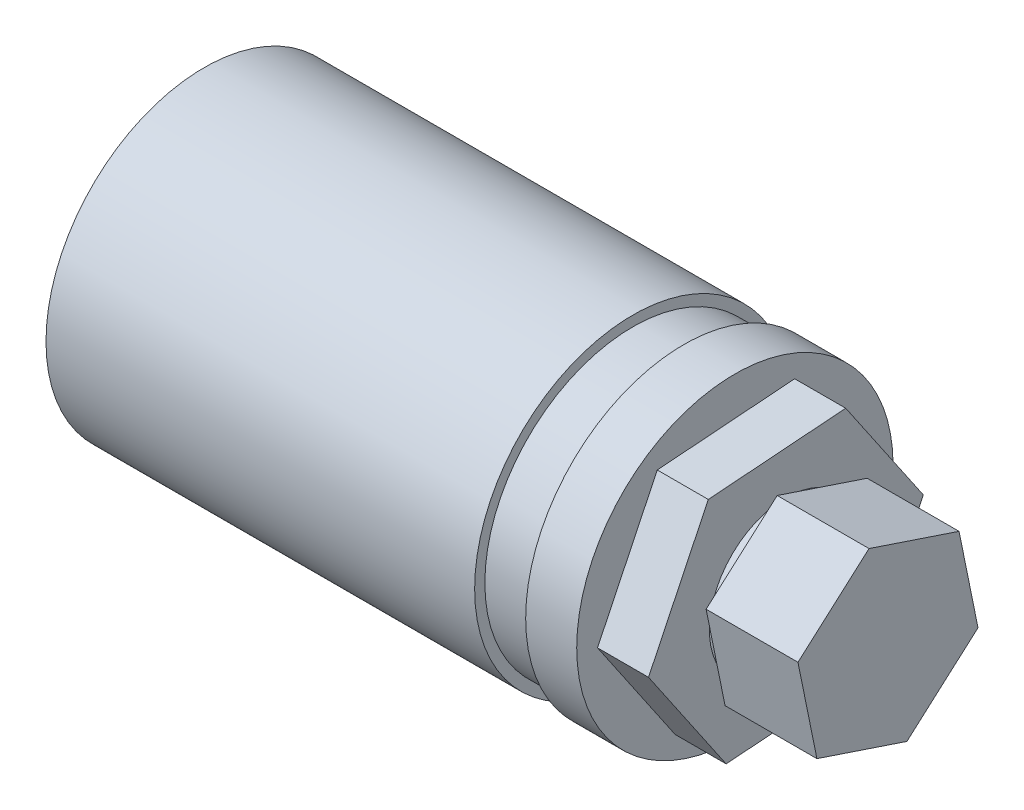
ISO-10303-21;
HEADER;
FILE_DESCRIPTION(('STEP AP214'),'2;1');
FILE_NAME('part.step','',(''),(''),'','','');
FILE_SCHEMA(('AUTOMOTIVE_DESIGN { 1 0 10303 214 1 1 1 1 }'));
ENDSEC;
DATA;
#1=APPLICATION_CONTEXT('core data for automotive mechanical design processes');
#2=APPLICATION_PROTOCOL_DEFINITION('international standard','automotive_design',2000,#1);
#3=PRODUCT_CONTEXT('',#1,'mechanical');
#4=PRODUCT('Part','Part','',(#3));
#5=PRODUCT_RELATED_PRODUCT_CATEGORY('part','',(#4));
#6=PRODUCT_DEFINITION_FORMATION('','',#4);
#7=PRODUCT_DEFINITION_CONTEXT('part definition',#1,'design');
#8=PRODUCT_DEFINITION('design','',#6,#7);
#9=PRODUCT_DEFINITION_SHAPE('','',#8);
#10=(LENGTH_UNIT() NAMED_UNIT(*) SI_UNIT(.MILLI.,.METRE.));
#11=(NAMED_UNIT(*) PLANE_ANGLE_UNIT() SI_UNIT($,.RADIAN.));
#12=(NAMED_UNIT(*) SI_UNIT($,.STERADIAN.) SOLID_ANGLE_UNIT());
#13=UNCERTAINTY_MEASURE_WITH_UNIT(LENGTH_MEASURE(1.E-05),#10,'distance_accuracy_value','');
#14=(GEOMETRIC_REPRESENTATION_CONTEXT(3) GLOBAL_UNCERTAINTY_ASSIGNED_CONTEXT((#13)) GLOBAL_UNIT_ASSIGNED_CONTEXT((#10,
#11,#12)) REPRESENTATION_CONTEXT('',''));
#15=CARTESIAN_POINT('',(0.,0.,0.));
#16=DIRECTION('',(0.,0.,1.));
#17=DIRECTION('',(1.,0.,0.));
#18=AXIS2_PLACEMENT_3D('',#15,#16,#17);
#19=CARTESIAN_POINT('',(52.,15.5,0.));
#20=DIRECTION('',(-1.,0.,0.));
#21=DIRECTION('',(0.,0.,1.));
#22=AXIS2_PLACEMENT_3D('',#19,#20,#21);
#23=PLANE('',#22);
#24=CARTESIAN_POINT('',(52.,0.,0.));
#25=DIRECTION('',(-1.,0.,0.));
#26=DIRECTION('',(0.,0.,1.));
#27=AXIS2_PLACEMENT_3D('',#24,#25,#26);
#28=CIRCLE('',#27,15.5);
#29=CARTESIAN_POINT('',(52.,0.,15.5));
#30=VERTEX_POINT('',#29);
#31=EDGE_CURVE('E198',#30,#30,#28,.T.);
#32=ORIENTED_EDGE('',*,*,#31,.F.);
#33=EDGE_LOOP('',(#32));
#34=FACE_BOUND('',#33,.T.);
#35=DIRECTION('',(0.,-0.0747918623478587,0.997199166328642));
#36=VECTOR('',#35,1.);
#37=CARTESIAN_POINT('',(52.,12.1634425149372,-5.85667706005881));
#38=LINE('',#37,#36);
#39=CARTESIAN_POINT('',(52.,12.1634425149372,-5.85667706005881));
#40=VERTEX_POINT('',#39);
#41=CARTESIAN_POINT('',(52.,11.1537523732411,7.60551168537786));
#42=VERTEX_POINT('',#41);
#43=EDGE_CURVE('E49',#40,#42,#38,.T.);
#44=ORIENTED_EDGE('',*,*,#43,.F.);
#45=DIRECTION('',(0.,0.826203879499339,0.563371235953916));
#46=VECTOR('',#45,1.);
#47=CARTESIAN_POINT('',(52.,1.00969014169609,-13.4621887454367));
#48=LINE('',#47,#46);
#49=CARTESIAN_POINT('',(52.,1.00969014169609,-13.4621887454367));
#50=VERTEX_POINT('',#49);
#51=EDGE_CURVE('E53',#50,#40,#48,.T.);
#52=ORIENTED_EDGE('',*,*,#51,.F.);
#53=DIRECTION('',(0.,0.900995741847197,-0.433827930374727));
#54=VECTOR('',#53,1.);
#55=CARTESIAN_POINT('',(52.,-11.1537523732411,-7.60551168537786));
#56=LINE('',#55,#54);
#57=CARTESIAN_POINT('',(52.,-11.1537523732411,-7.60551168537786));
#58=VERTEX_POINT('',#57);
#59=EDGE_CURVE('E178',#58,#50,#56,.T.);
#60=ORIENTED_EDGE('',*,*,#59,.F.);
#61=DIRECTION('',(0.,0.0747918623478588,-0.997199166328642));
#62=VECTOR('',#61,1.);
#63=CARTESIAN_POINT('',(52.,-12.1634425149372,5.8566770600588));
#64=LINE('',#63,#62);
#65=CARTESIAN_POINT('',(52.,-12.1634425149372,5.8566770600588));
#66=VERTEX_POINT('',#65);
#67=EDGE_CURVE('E175',#66,#58,#64,.T.);
#68=ORIENTED_EDGE('',*,*,#67,.F.);
#69=DIRECTION('',(0.,-0.826203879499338,-0.563371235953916));
#70=VECTOR('',#69,1.);
#71=CARTESIAN_POINT('',(52.,-1.00969014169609,13.4621887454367));
#72=LINE('',#71,#70);
#73=CARTESIAN_POINT('',(52.,-1.00969014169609,13.4621887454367));
#74=VERTEX_POINT('',#73);
#75=EDGE_CURVE('E172',#74,#66,#72,.T.);
#76=ORIENTED_EDGE('',*,*,#75,.F.);
#77=DIRECTION('',(0.,-0.900995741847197,0.433827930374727));
#78=VECTOR('',#77,1.);
#79=CARTESIAN_POINT('',(52.,11.1537523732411,7.60551168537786));
#80=LINE('',#79,#78);
#81=EDGE_CURVE('E169',#42,#74,#80,.T.);
#82=ORIENTED_EDGE('',*,*,#81,.F.);
#83=EDGE_LOOP('',(#44,#52,#60,#68,#76,#82));
#84=FACE_BOUND('',#83,.T.);
#85=ADVANCED_FACE('F33',(#34,#84),#23,.F.);
#86=CARTESIAN_POINT('',(0.,0.,0.));
#87=DIRECTION('',(1.,0.,0.));
#88=DIRECTION('',(0.,0.,-1.));
#89=AXIS2_PLACEMENT_3D('',#86,#87,#88);
#90=PLANE('',#89);
#91=CARTESIAN_POINT('',(0.,0.,0.));
#92=DIRECTION('',(-1.,0.,0.));
#93=DIRECTION('',(0.,0.,1.));
#94=AXIS2_PLACEMENT_3D('',#91,#92,#93);
#95=CIRCLE('',#94,15.5);
#96=CARTESIAN_POINT('',(0.,0.,15.5));
#97=VERTEX_POINT('',#96);
#98=EDGE_CURVE('E37',#97,#97,#95,.T.);
#99=ORIENTED_EDGE('',*,*,#98,.T.);
#100=EDGE_LOOP('',(#99));
#101=FACE_BOUND('',#100,.T.);
#102=ADVANCED_FACE('F35',(#101),#90,.F.);
#103=CARTESIAN_POINT('',(0.,0.,0.));
#104=DIRECTION('',(-1.,0.,0.));
#105=DIRECTION('',(0.,0.,1.));
#106=AXIS2_PLACEMENT_3D('',#103,#104,#105);
#107=CYLINDRICAL_SURFACE('',#106,15.5);
#108=ORIENTED_EDGE('',*,*,#98,.F.);
#109=EDGE_LOOP('',(#108));
#110=FACE_BOUND('',#109,.T.);
#111=CARTESIAN_POINT('',(42.,0.,0.));
#112=DIRECTION('',(-1.,0.,0.));
#113=DIRECTION('',(0.,0.,1.));
#114=AXIS2_PLACEMENT_3D('',#111,#112,#113);
#115=CIRCLE('',#114,15.5);
#116=CARTESIAN_POINT('',(42.,0.,15.5));
#117=VERTEX_POINT('',#116);
#118=EDGE_CURVE('E209',#117,#117,#115,.T.);
#119=ORIENTED_EDGE('',*,*,#118,.T.);
#120=EDGE_LOOP('',(#119));
#121=FACE_BOUND('',#120,.T.);
#122=ADVANCED_FACE('F217',(#110,#121),#107,.T.);
#123=CARTESIAN_POINT('',(42.,15.5,0.));
#124=DIRECTION('',(-1.,0.,0.));
#125=DIRECTION('',(0.,0.,1.));
#126=AXIS2_PLACEMENT_3D('',#123,#124,#125);
#127=PLANE('',#126);
#128=ORIENTED_EDGE('',*,*,#118,.F.);
#129=EDGE_LOOP('',(#128));
#130=FACE_BOUND('',#129,.T.);
#131=CARTESIAN_POINT('',(42.,0.,0.));
#132=DIRECTION('',(-1.,0.,0.));
#133=DIRECTION('',(0.,0.,1.));
#134=AXIS2_PLACEMENT_3D('',#131,#132,#133);
#135=CIRCLE('',#134,14.5);
#136=CARTESIAN_POINT('',(42.,0.,14.5));
#137=VERTEX_POINT('',#136);
#138=EDGE_CURVE('E207',#137,#137,#135,.T.);
#139=ORIENTED_EDGE('',*,*,#138,.T.);
#140=EDGE_LOOP('',(#139));
#141=FACE_BOUND('',#140,.T.);
#142=ADVANCED_FACE('F219',(#130,#141),#127,.F.);
#143=CARTESIAN_POINT('',(0.,0.,0.));
#144=DIRECTION('',(-1.,0.,0.));
#145=DIRECTION('',(0.,0.,1.));
#146=AXIS2_PLACEMENT_3D('',#143,#144,#145);
#147=CYLINDRICAL_SURFACE('',#146,14.5);
#148=ORIENTED_EDGE('',*,*,#138,.F.);
#149=EDGE_LOOP('',(#148));
#150=FACE_BOUND('',#149,.T.);
#151=CARTESIAN_POINT('',(47.,0.,0.));
#152=DIRECTION('',(-1.,0.,0.));
#153=DIRECTION('',(0.,0.,1.));
#154=AXIS2_PLACEMENT_3D('',#151,#152,#153);
#155=CIRCLE('',#154,14.5);
#156=CARTESIAN_POINT('',(47.,0.,14.5));
#157=VERTEX_POINT('',#156);
#158=EDGE_CURVE('E204',#157,#157,#155,.T.);
#159=ORIENTED_EDGE('',*,*,#158,.T.);
#160=EDGE_LOOP('',(#159));
#161=FACE_BOUND('',#160,.T.);
#162=ADVANCED_FACE('F224',(#150,#161),#147,.T.);
#163=CARTESIAN_POINT('',(47.,14.5,0.));
#164=DIRECTION('',(1.,0.,0.));
#165=DIRECTION('',(0.,0.,-1.));
#166=AXIS2_PLACEMENT_3D('',#163,#164,#165);
#167=PLANE('',#166);
#168=ORIENTED_EDGE('',*,*,#158,.F.);
#169=EDGE_LOOP('',(#168));
#170=FACE_BOUND('',#169,.T.);
#171=CARTESIAN_POINT('',(47.,0.,0.));
#172=DIRECTION('',(-1.,0.,0.));
#173=DIRECTION('',(0.,0.,1.));
#174=AXIS2_PLACEMENT_3D('',#171,#172,#173);
#175=CIRCLE('',#174,15.5);
#176=CARTESIAN_POINT('',(47.,0.,15.5));
#177=VERTEX_POINT('',#176);
#178=EDGE_CURVE('E201',#177,#177,#175,.T.);
#179=ORIENTED_EDGE('',*,*,#178,.T.);
#180=EDGE_LOOP('',(#179));
#181=FACE_BOUND('',#180,.T.);
#182=ADVANCED_FACE('F240',(#170,#181),#167,.F.);
#183=CARTESIAN_POINT('',(0.,0.,0.));
#184=DIRECTION('',(-1.,0.,0.));
#185=DIRECTION('',(0.,0.,1.));
#186=AXIS2_PLACEMENT_3D('',#183,#184,#185);
#187=CYLINDRICAL_SURFACE('',#186,15.5);
#188=ORIENTED_EDGE('',*,*,#178,.F.);
#189=EDGE_LOOP('',(#188));
#190=FACE_BOUND('',#189,.T.);
#191=ORIENTED_EDGE('',*,*,#31,.T.);
#192=EDGE_LOOP('',(#191));
#193=FACE_BOUND('',#192,.T.);
#194=ADVANCED_FACE('F237',(#190,#193),#187,.T.);
#195=CARTESIAN_POINT('',(57.,12.1634425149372,-5.85667706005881));
#196=DIRECTION('',(0.,-0.997199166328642,-0.0747918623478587));
#197=DIRECTION('',(0.,0.0747918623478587,-0.997199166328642));
#198=AXIS2_PLACEMENT_3D('',#195,#196,#197);
#199=PLANE('',#198);
#200=ORIENTED_EDGE('',*,*,#43,.T.);
#201=DIRECTION('',(-1.,0.,0.));
#202=VECTOR('',#201,1.);
#203=CARTESIAN_POINT('',(57.,11.1537523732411,7.60551168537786));
#204=LINE('',#203,#202);
#205=CARTESIAN_POINT('',(57.,11.1537523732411,7.60551168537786));
#206=VERTEX_POINT('',#205);
#207=EDGE_CURVE('E195',#206,#42,#204,.T.);
#208=ORIENTED_EDGE('',*,*,#207,.F.);
#209=DIRECTION('',(0.,-0.0747918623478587,0.997199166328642));
#210=VECTOR('',#209,1.);
#211=CARTESIAN_POINT('',(57.,12.1634425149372,-5.85667706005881));
#212=LINE('',#211,#210);
#213=CARTESIAN_POINT('',(57.,12.1634425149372,-5.85667706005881));
#214=VERTEX_POINT('',#213);
#215=EDGE_CURVE('E154',#214,#206,#212,.T.);
#216=ORIENTED_EDGE('',*,*,#215,.F.);
#217=DIRECTION('',(-1.,0.,0.));
#218=VECTOR('',#217,1.);
#219=CARTESIAN_POINT('',(57.,12.1634425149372,-5.85667706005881));
#220=LINE('',#219,#218);
#221=EDGE_CURVE('E167',#214,#40,#220,.T.);
#222=ORIENTED_EDGE('',*,*,#221,.T.);
#223=EDGE_LOOP('',(#200,#208,#216,#222));
#224=FACE_BOUND('',#223,.T.);
#225=ADVANCED_FACE('F235',(#224),#199,.F.);
#226=CARTESIAN_POINT('',(57.,11.1537523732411,7.60551168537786));
#227=DIRECTION('',(0.,-0.433827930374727,-0.900995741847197));
#228=DIRECTION('',(0.,0.900995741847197,-0.433827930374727));
#229=AXIS2_PLACEMENT_3D('',#226,#227,#228);
#230=PLANE('',#229);
#231=ORIENTED_EDGE('',*,*,#81,.T.);
#232=DIRECTION('',(-1.,0.,0.));
#233=VECTOR('',#232,1.);
#234=CARTESIAN_POINT('',(57.,-1.00969014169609,13.4621887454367));
#235=LINE('',#234,#233);
#236=CARTESIAN_POINT('',(57.,-1.00969014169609,13.4621887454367));
#237=VERTEX_POINT('',#236);
#238=EDGE_CURVE('E192',#237,#74,#235,.T.);
#239=ORIENTED_EDGE('',*,*,#238,.F.);
#240=DIRECTION('',(0.,-0.900995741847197,0.433827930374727));
#241=VECTOR('',#240,1.);
#242=CARTESIAN_POINT('',(57.,11.1537523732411,7.60551168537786));
#243=LINE('',#242,#241);
#244=EDGE_CURVE('E157',#206,#237,#243,.T.);
#245=ORIENTED_EDGE('',*,*,#244,.F.);
#246=ORIENTED_EDGE('',*,*,#207,.T.);
#247=EDGE_LOOP('',(#231,#239,#245,#246));
#248=FACE_BOUND('',#247,.T.);
#249=ADVANCED_FACE('F272',(#248),#230,.F.);
#250=CARTESIAN_POINT('',(57.,-1.00969014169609,13.4621887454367));
#251=DIRECTION('',(0.,0.563371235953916,-0.826203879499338));
#252=DIRECTION('',(0.,0.826203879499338,0.563371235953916));
#253=AXIS2_PLACEMENT_3D('',#250,#251,#252);
#254=PLANE('',#253);
#255=ORIENTED_EDGE('',*,*,#75,.T.);
#256=DIRECTION('',(-1.,0.,0.));
#257=VECTOR('',#256,1.);
#258=CARTESIAN_POINT('',(57.,-12.1634425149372,5.8566770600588));
#259=LINE('',#258,#257);
#260=CARTESIAN_POINT('',(57.,-12.1634425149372,5.8566770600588));
#261=VERTEX_POINT('',#260);
#262=EDGE_CURVE('E189',#261,#66,#259,.T.);
#263=ORIENTED_EDGE('',*,*,#262,.F.);
#264=DIRECTION('',(0.,-0.826203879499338,-0.563371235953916));
#265=VECTOR('',#264,1.);
#266=CARTESIAN_POINT('',(57.,-1.00969014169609,13.4621887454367));
#267=LINE('',#266,#265);
#268=EDGE_CURVE('E159',#237,#261,#267,.T.);
#269=ORIENTED_EDGE('',*,*,#268,.F.);
#270=ORIENTED_EDGE('',*,*,#238,.T.);
#271=EDGE_LOOP('',(#255,#263,#269,#270));
#272=FACE_BOUND('',#271,.T.);
#273=ADVANCED_FACE('F279',(#272),#254,.F.);
#274=CARTESIAN_POINT('',(57.,-12.1634425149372,5.8566770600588));
#275=DIRECTION('',(0.,0.997199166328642,0.0747918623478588));
#276=DIRECTION('',(0.,-0.0747918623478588,0.997199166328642));
#277=AXIS2_PLACEMENT_3D('',#274,#275,#276);
#278=PLANE('',#277);
#279=ORIENTED_EDGE('',*,*,#67,.T.);
#280=DIRECTION('',(-1.,0.,0.));
#281=VECTOR('',#280,1.);
#282=CARTESIAN_POINT('',(57.,-11.1537523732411,-7.60551168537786));
#283=LINE('',#282,#281);
#284=CARTESIAN_POINT('',(57.,-11.1537523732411,-7.60551168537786));
#285=VERTEX_POINT('',#284);
#286=EDGE_CURVE('E186',#285,#58,#283,.T.);
#287=ORIENTED_EDGE('',*,*,#286,.F.);
#288=DIRECTION('',(0.,0.0747918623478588,-0.997199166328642));
#289=VECTOR('',#288,1.);
#290=CARTESIAN_POINT('',(57.,-12.1634425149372,5.8566770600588));
#291=LINE('',#290,#289);
#292=EDGE_CURVE('E161',#261,#285,#291,.T.);
#293=ORIENTED_EDGE('',*,*,#292,.F.);
#294=ORIENTED_EDGE('',*,*,#262,.T.);
#295=EDGE_LOOP('',(#279,#287,#293,#294));
#296=FACE_BOUND('',#295,.T.);
#297=ADVANCED_FACE('F286',(#296),#278,.F.);
#298=CARTESIAN_POINT('',(57.,-11.1537523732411,-7.60551168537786));
#299=DIRECTION('',(0.,0.433827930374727,0.900995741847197));
#300=DIRECTION('',(0.,-0.900995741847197,0.433827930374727));
#301=AXIS2_PLACEMENT_3D('',#298,#299,#300);
#302=PLANE('',#301);
#303=ORIENTED_EDGE('',*,*,#59,.T.);
#304=DIRECTION('',(-1.,0.,0.));
#305=VECTOR('',#304,1.);
#306=CARTESIAN_POINT('',(57.,1.00969014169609,-13.4621887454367));
#307=LINE('',#306,#305);
#308=CARTESIAN_POINT('',(57.,1.00969014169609,-13.4621887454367));
#309=VERTEX_POINT('',#308);
#310=EDGE_CURVE('E183',#309,#50,#307,.T.);
#311=ORIENTED_EDGE('',*,*,#310,.F.);
#312=DIRECTION('',(0.,0.900995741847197,-0.433827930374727));
#313=VECTOR('',#312,1.);
#314=CARTESIAN_POINT('',(57.,-11.1537523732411,-7.60551168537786));
#315=LINE('',#314,#313);
#316=EDGE_CURVE('E163',#285,#309,#315,.T.);
#317=ORIENTED_EDGE('',*,*,#316,.F.);
#318=ORIENTED_EDGE('',*,*,#286,.T.);
#319=EDGE_LOOP('',(#303,#311,#317,#318));
#320=FACE_BOUND('',#319,.T.);
#321=ADVANCED_FACE('F294',(#320),#302,.F.);
#322=CARTESIAN_POINT('',(57.,1.00969014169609,-13.4621887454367));
#323=DIRECTION('',(0.,-0.563371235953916,0.826203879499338));
#324=DIRECTION('',(0.,-0.826203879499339,-0.563371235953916));
#325=AXIS2_PLACEMENT_3D('',#322,#323,#324);
#326=PLANE('',#325);
#327=ORIENTED_EDGE('',*,*,#51,.T.);
#328=ORIENTED_EDGE('',*,*,#221,.F.);
#329=DIRECTION('',(0.,0.826203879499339,0.563371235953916));
#330=VECTOR('',#329,1.);
#331=CARTESIAN_POINT('',(57.,1.00969014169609,-13.4621887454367));
#332=LINE('',#331,#330);
#333=EDGE_CURVE('E165',#309,#214,#332,.T.);
#334=ORIENTED_EDGE('',*,*,#333,.F.);
#335=ORIENTED_EDGE('',*,*,#310,.T.);
#336=EDGE_LOOP('',(#327,#328,#334,#335));
#337=FACE_BOUND('',#336,.T.);
#338=ADVANCED_FACE('F302',(#337),#326,.F.);
#339=CARTESIAN_POINT('',(57.,0.,0.));
#340=DIRECTION('',(1.,0.,0.));
#341=DIRECTION('',(0.,0.,-1.));
#342=AXIS2_PLACEMENT_3D('',#339,#340,#341);
#343=PLANE('',#342);
#344=CARTESIAN_POINT('',(57.,0.,0.));
#345=DIRECTION('',(1.,0.,0.));
#346=DIRECTION('',(0.,0.,-1.));
#347=AXIS2_PLACEMENT_3D('',#344,#345,#346);
#348=CIRCLE('',#347,7.5);
#349=CARTESIAN_POINT('',(57.,0.,-7.5));
#350=VERTEX_POINT('',#349);
#351=EDGE_CURVE('E11',#350,#350,#348,.T.);
#352=ORIENTED_EDGE('',*,*,#351,.F.);
#353=EDGE_LOOP('',(#352));
#354=FACE_BOUND('',#353,.T.);
#355=ORIENTED_EDGE('',*,*,#215,.T.);
#356=ORIENTED_EDGE('',*,*,#244,.T.);
#357=ORIENTED_EDGE('',*,*,#268,.T.);
#358=ORIENTED_EDGE('',*,*,#292,.T.);
#359=ORIENTED_EDGE('',*,*,#316,.T.);
#360=ORIENTED_EDGE('',*,*,#333,.T.);
#361=EDGE_LOOP('',(#355,#356,#357,#358,#359,#360));
#362=FACE_BOUND('',#361,.T.);
#363=ADVANCED_FACE('F310',(#354,#362),#343,.T.);
#364=CARTESIAN_POINT('',(58.,0.,0.));
#365=DIRECTION('',(-1.,0.,0.));
#366=DIRECTION('',(0.,0.,1.));
#367=AXIS2_PLACEMENT_3D('',#364,#365,#366);
#368=CYLINDRICAL_SURFACE('',#367,7.5);
#369=CARTESIAN_POINT('',(58.,0.,0.));
#370=DIRECTION('',(1.,0.,0.));
#371=DIRECTION('',(0.,0.,-1.));
#372=AXIS2_PLACEMENT_3D('',#369,#370,#371);
#373=CIRCLE('',#372,7.5);
#374=CARTESIAN_POINT('',(58.,0.,-7.5));
#375=VERTEX_POINT('',#374);
#376=EDGE_CURVE('E146',#375,#375,#373,.T.);
#377=ORIENTED_EDGE('',*,*,#376,.F.);
#378=EDGE_LOOP('',(#377));
#379=FACE_BOUND('',#378,.T.);
#380=ORIENTED_EDGE('',*,*,#351,.T.);
#381=EDGE_LOOP('',(#380));
#382=FACE_BOUND('',#381,.T.);
#383=ADVANCED_FACE('F318',(#379,#382),#368,.T.);
#384=CARTESIAN_POINT('',(67.,6.16510692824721,-6.96286267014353));
#385=DIRECTION('',(0.,-0.948448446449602,0.316931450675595));
#386=DIRECTION('',(0.,-0.316931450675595,-0.948448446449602));
#387=AXIS2_PLACEMENT_3D('',#384,#385,#386);
#388=PLANE('',#387);
#389=DIRECTION('',(0.,0.316931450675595,0.948448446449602));
#390=VECTOR('',#389,1.);
#391=CARTESIAN_POINT('',(58.,6.16510692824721,-6.96286267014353));
#392=LINE('',#391,#390);
#393=CARTESIAN_POINT('',(58.,6.16510692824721,-6.96286267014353));
#394=VERTEX_POINT('',#393);
#395=CARTESIAN_POINT('',(58.,9.11256941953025,1.85770788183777));
#396=VERTEX_POINT('',#395);
#397=EDGE_CURVE('E145',#394,#396,#392,.T.);
#398=ORIENTED_EDGE('',*,*,#397,.T.);
#399=DIRECTION('',(-1.,0.,0.));
#400=VECTOR('',#399,1.);
#401=CARTESIAN_POINT('',(67.,9.11256941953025,1.85770788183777));
#402=LINE('',#401,#400);
#403=CARTESIAN_POINT('',(67.,9.11256941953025,1.85770788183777));
#404=VERTEX_POINT('',#403);
#405=EDGE_CURVE('E125',#404,#396,#402,.T.);
#406=ORIENTED_EDGE('',*,*,#405,.F.);
#407=DIRECTION('',(0.,0.316931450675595,0.948448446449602));
#408=VECTOR('',#407,1.);
#409=CARTESIAN_POINT('',(67.,6.16510692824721,-6.96286267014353));
#410=LINE('',#409,#408);
#411=CARTESIAN_POINT('',(67.,6.16510692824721,-6.96286267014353));
#412=VERTEX_POINT('',#411);
#413=EDGE_CURVE('E132',#412,#404,#410,.T.);
#414=ORIENTED_EDGE('',*,*,#413,.F.);
#415=DIRECTION('',(-1.,0.,0.));
#416=VECTOR('',#415,1.);
#417=CARTESIAN_POINT('',(67.,6.16510692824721,-6.96286267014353));
#418=LINE('',#417,#416);
#419=EDGE_CURVE('E461',#412,#394,#418,.T.);
#420=ORIENTED_EDGE('',*,*,#419,.T.);
#421=EDGE_LOOP('',(#398,#406,#414,#420));
#422=FACE_BOUND('',#421,.T.);
#423=ADVANCED_FACE('F143',(#422),#388,.F.);
#424=CARTESIAN_POINT('',(67.,9.11256941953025,1.85770788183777));
#425=DIRECTION('',(0.,-0.748694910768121,-0.662914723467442));
#426=DIRECTION('',(0.,0.662914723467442,-0.748694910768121));
#427=AXIS2_PLACEMENT_3D('',#424,#425,#426);
#428=PLANE('',#427);
#429=DIRECTION('',(0.,-0.662914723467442,0.748694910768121));
#430=VECTOR('',#429,1.);
#431=CARTESIAN_POINT('',(58.,9.11256941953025,1.85770788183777));
#432=LINE('',#431,#430);
#433=CARTESIAN_POINT('',(58.,2.94746249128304,8.8205705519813));
#434=VERTEX_POINT('',#433);
#435=EDGE_CURVE('E448',#396,#434,#432,.T.);
#436=ORIENTED_EDGE('',*,*,#435,.T.);
#437=DIRECTION('',(-1.,0.,0.));
#438=VECTOR('',#437,1.);
#439=CARTESIAN_POINT('',(67.,2.94746249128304,8.8205705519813));
#440=LINE('',#439,#438);
#441=CARTESIAN_POINT('',(67.,2.94746249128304,8.8205705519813));
#442=VERTEX_POINT('',#441);
#443=EDGE_CURVE('E128',#442,#434,#440,.T.);
#444=ORIENTED_EDGE('',*,*,#443,.F.);
#445=DIRECTION('',(0.,-0.662914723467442,0.748694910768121));
#446=VECTOR('',#445,1.);
#447=CARTESIAN_POINT('',(67.,9.11256941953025,1.85770788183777));
#448=LINE('',#447,#446);
#449=EDGE_CURVE('E121',#404,#442,#448,.T.);
#450=ORIENTED_EDGE('',*,*,#449,.F.);
#451=ORIENTED_EDGE('',*,*,#405,.T.);
#452=EDGE_LOOP('',(#436,#444,#450,#451));
#453=FACE_BOUND('',#452,.T.);
#454=ADVANCED_FACE('F123',(#453),#428,.F.);
#455=CARTESIAN_POINT('',(67.,2.94746249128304,8.8205705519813));
#456=DIRECTION('',(0.,0.19975353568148,-0.979846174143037));
#457=DIRECTION('',(0.,0.979846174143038,0.19975353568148));
#458=AXIS2_PLACEMENT_3D('',#455,#456,#457);
#459=PLANE('',#458);
#460=DIRECTION('',(0.,-0.979846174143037,-0.19975353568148));
#461=VECTOR('',#460,1.);
#462=CARTESIAN_POINT('',(58.,2.94746249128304,8.8205705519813));
#463=LINE('',#462,#461);
#464=CARTESIAN_POINT('',(58.,-6.16510692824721,6.96286267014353));
#465=VERTEX_POINT('',#464);
#466=EDGE_CURVE('E450',#434,#465,#463,.T.);
#467=ORIENTED_EDGE('',*,*,#466,.T.);
#468=DIRECTION('',(-1.,0.,0.));
#469=VECTOR('',#468,1.);
#470=CARTESIAN_POINT('',(67.,-6.16510692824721,6.96286267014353));
#471=LINE('',#470,#469);
#472=CARTESIAN_POINT('',(67.,-6.16510692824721,6.96286267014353));
#473=VERTEX_POINT('',#472);
#474=EDGE_CURVE('E150',#473,#465,#471,.T.);
#475=ORIENTED_EDGE('',*,*,#474,.F.);
#476=DIRECTION('',(0.,-0.979846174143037,-0.19975353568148));
#477=VECTOR('',#476,1.);
#478=CARTESIAN_POINT('',(67.,2.94746249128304,8.8205705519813));
#479=LINE('',#478,#477);
#480=EDGE_CURVE('E131',#442,#473,#479,.T.);
#481=ORIENTED_EDGE('',*,*,#480,.F.);
#482=ORIENTED_EDGE('',*,*,#443,.T.);
#483=EDGE_LOOP('',(#467,#475,#481,#482));
#484=FACE_BOUND('',#483,.T.);
#485=ADVANCED_FACE('F339',(#484),#459,.F.);
#486=CARTESIAN_POINT('',(67.,-6.16510692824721,6.96286267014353));
#487=DIRECTION('',(0.,0.948448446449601,-0.316931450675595));
#488=DIRECTION('',(0.,0.316931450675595,0.948448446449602));
#489=AXIS2_PLACEMENT_3D('',#486,#487,#488);
#490=PLANE('',#489);
#491=DIRECTION('',(0.,-0.316931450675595,-0.948448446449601));
#492=VECTOR('',#491,1.);
#493=CARTESIAN_POINT('',(58.,-6.16510692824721,6.96286267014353));
#494=LINE('',#493,#492);
#495=CARTESIAN_POINT('',(58.,-9.11256941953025,-1.85770788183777));
#496=VERTEX_POINT('',#495);
#497=EDGE_CURVE('E456',#465,#496,#494,.T.);
#498=ORIENTED_EDGE('',*,*,#497,.T.);
#499=DIRECTION('',(-1.,0.,0.));
#500=VECTOR('',#499,1.);
#501=CARTESIAN_POINT('',(67.,-9.11256941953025,-1.85770788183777));
#502=LINE('',#501,#500);
#503=CARTESIAN_POINT('',(67.,-9.11256941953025,-1.85770788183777));
#504=VERTEX_POINT('',#503);
#505=EDGE_CURVE('E466',#504,#496,#502,.T.);
#506=ORIENTED_EDGE('',*,*,#505,.F.);
#507=DIRECTION('',(0.,-0.316931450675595,-0.948448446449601));
#508=VECTOR('',#507,1.);
#509=CARTESIAN_POINT('',(67.,-6.16510692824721,6.96286267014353));
#510=LINE('',#509,#508);
#511=EDGE_CURVE('E473',#473,#504,#510,.T.);
#512=ORIENTED_EDGE('',*,*,#511,.F.);
#513=ORIENTED_EDGE('',*,*,#474,.T.);
#514=EDGE_LOOP('',(#498,#506,#512,#513));
#515=FACE_BOUND('',#514,.T.);
#516=ADVANCED_FACE('F346',(#515),#490,.F.);
#517=CARTESIAN_POINT('',(67.,-9.11256941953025,-1.85770788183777));
#518=DIRECTION('',(0.,0.748694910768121,0.662914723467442));
#519=DIRECTION('',(0.,-0.662914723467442,0.748694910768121));
#520=AXIS2_PLACEMENT_3D('',#517,#518,#519);
#521=PLANE('',#520);
#522=DIRECTION('',(0.,0.662914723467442,-0.748694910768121));
#523=VECTOR('',#522,1.);
#524=CARTESIAN_POINT('',(58.,-9.11256941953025,-1.85770788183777));
#525=LINE('',#524,#523);
#526=CARTESIAN_POINT('',(58.,-2.94746249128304,-8.8205705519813));
#527=VERTEX_POINT('',#526);
#528=EDGE_CURVE('E458',#496,#527,#525,.T.);
#529=ORIENTED_EDGE('',*,*,#528,.T.);
#530=DIRECTION('',(-1.,0.,0.));
#531=VECTOR('',#530,1.);
#532=CARTESIAN_POINT('',(67.,-2.94746249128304,-8.8205705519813));
#533=LINE('',#532,#531);
#534=CARTESIAN_POINT('',(67.,-2.94746249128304,-8.8205705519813));
#535=VERTEX_POINT('',#534);
#536=EDGE_CURVE('E463',#535,#527,#533,.T.);
#537=ORIENTED_EDGE('',*,*,#536,.F.);
#538=DIRECTION('',(0.,0.662914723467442,-0.748694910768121));
#539=VECTOR('',#538,1.);
#540=CARTESIAN_POINT('',(67.,-9.11256941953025,-1.85770788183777));
#541=LINE('',#540,#539);
#542=EDGE_CURVE('E476',#504,#535,#541,.T.);
#543=ORIENTED_EDGE('',*,*,#542,.F.);
#544=ORIENTED_EDGE('',*,*,#505,.T.);
#545=EDGE_LOOP('',(#529,#537,#543,#544));
#546=FACE_BOUND('',#545,.T.);
#547=ADVANCED_FACE('F354',(#546),#521,.F.);
#548=CARTESIAN_POINT('',(67.,-2.94746249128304,-8.8205705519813));
#549=DIRECTION('',(0.,-0.19975353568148,0.979846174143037));
#550=DIRECTION('',(0.,-0.979846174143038,-0.19975353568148));
#551=AXIS2_PLACEMENT_3D('',#548,#549,#550);
#552=PLANE('',#551);
#553=DIRECTION('',(0.,0.979846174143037,0.19975353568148));
#554=VECTOR('',#553,1.);
#555=CARTESIAN_POINT('',(58.,-2.94746249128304,-8.8205705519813));
#556=LINE('',#555,#554);
#557=EDGE_CURVE('E141',#527,#394,#556,.T.);
#558=ORIENTED_EDGE('',*,*,#557,.T.);
#559=ORIENTED_EDGE('',*,*,#419,.F.);
#560=DIRECTION('',(0.,0.979846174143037,0.19975353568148));
#561=VECTOR('',#560,1.);
#562=CARTESIAN_POINT('',(67.,-2.94746249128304,-8.8205705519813));
#563=LINE('',#562,#561);
#564=EDGE_CURVE('E137',#535,#412,#563,.T.);
#565=ORIENTED_EDGE('',*,*,#564,.F.);
#566=ORIENTED_EDGE('',*,*,#536,.T.);
#567=EDGE_LOOP('',(#558,#559,#565,#566));
#568=FACE_BOUND('',#567,.T.);
#569=ADVANCED_FACE('F362',(#568),#552,.F.);
#570=CARTESIAN_POINT('',(67.,0.,0.));
#571=DIRECTION('',(1.,0.,0.));
#572=DIRECTION('',(0.,0.,-1.));
#573=AXIS2_PLACEMENT_3D('',#570,#571,#572);
#574=PLANE('',#573);
#575=ORIENTED_EDGE('',*,*,#413,.T.);
#576=ORIENTED_EDGE('',*,*,#449,.T.);
#577=ORIENTED_EDGE('',*,*,#480,.T.);
#578=ORIENTED_EDGE('',*,*,#511,.T.);
#579=ORIENTED_EDGE('',*,*,#542,.T.);
#580=ORIENTED_EDGE('',*,*,#564,.T.);
#581=EDGE_LOOP('',(#575,#576,#577,#578,#579,#580));
#582=FACE_BOUND('',#581,.T.);
#583=ADVANCED_FACE('F135',(#582),#574,.T.);
#584=CARTESIAN_POINT('',(58.,0.,0.));
#585=DIRECTION('',(1.,0.,0.));
#586=DIRECTION('',(0.,0.,-1.));
#587=AXIS2_PLACEMENT_3D('',#584,#585,#586);
#588=PLANE('',#587);
#589=ORIENTED_EDGE('',*,*,#376,.T.);
#590=EDGE_LOOP('',(#589));
#591=FACE_BOUND('',#590,.T.);
#592=ORIENTED_EDGE('',*,*,#397,.F.);
#593=ORIENTED_EDGE('',*,*,#557,.F.);
#594=ORIENTED_EDGE('',*,*,#528,.F.);
#595=ORIENTED_EDGE('',*,*,#497,.F.);
#596=ORIENTED_EDGE('',*,*,#466,.F.);
#597=ORIENTED_EDGE('',*,*,#435,.F.);
#598=EDGE_LOOP('',(#592,#593,#594,#595,#596,#597));
#599=FACE_BOUND('',#598,.T.);
#600=ADVANCED_FACE('F377',(#591,#599),#588,.F.);
#601=CLOSED_SHELL('',(#85,#102,#122,#142,#162,#182,#194,#225,#249,#273,#297,#321,#338,#363,#383,
#423,#454,#485,#516,#547,#569,#583,#600));
#602=MANIFOLD_SOLID_BREP('B2',#601);
#603=ADVANCED_BREP_SHAPE_REPRESENTATION('',(#18,#602),#14);
#604=SHAPE_DEFINITION_REPRESENTATION(#9,#603);
ENDSEC;
END-ISO-10303-21;
